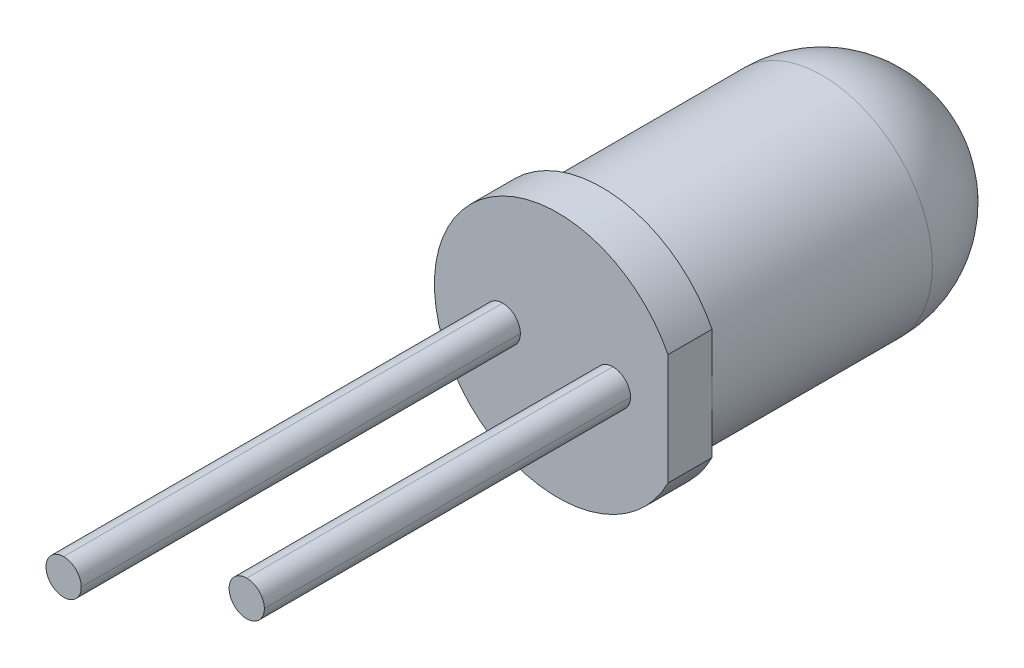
ISO-10303-21;
HEADER;
FILE_DESCRIPTION(('STEP AP214'),'2;1');
FILE_NAME('part.step','',(''),(''),'','','');
FILE_SCHEMA(('AUTOMOTIVE_DESIGN { 1 0 10303 214 1 1 1 1 }'));
ENDSEC;
DATA;
#1=APPLICATION_CONTEXT('core data for automotive mechanical design processes');
#2=APPLICATION_PROTOCOL_DEFINITION('international standard','automotive_design',2000,#1);
#3=PRODUCT_CONTEXT('',#1,'mechanical');
#4=PRODUCT('Part','Part','',(#3));
#5=PRODUCT_RELATED_PRODUCT_CATEGORY('part','',(#4));
#6=PRODUCT_DEFINITION_FORMATION('','',#4);
#7=PRODUCT_DEFINITION_CONTEXT('part definition',#1,'design');
#8=PRODUCT_DEFINITION('design','',#6,#7);
#9=PRODUCT_DEFINITION_SHAPE('','',#8);
#10=(LENGTH_UNIT() NAMED_UNIT(*) SI_UNIT(.MILLI.,.METRE.));
#11=(NAMED_UNIT(*) PLANE_ANGLE_UNIT() SI_UNIT($,.RADIAN.));
#12=(NAMED_UNIT(*) SI_UNIT($,.STERADIAN.) SOLID_ANGLE_UNIT());
#13=UNCERTAINTY_MEASURE_WITH_UNIT(LENGTH_MEASURE(1.E-05),#10,'distance_accuracy_value','');
#14=(GEOMETRIC_REPRESENTATION_CONTEXT(3) GLOBAL_UNCERTAINTY_ASSIGNED_CONTEXT((#13)) GLOBAL_UNIT_ASSIGNED_CONTEXT((#10,
#11,#12)) REPRESENTATION_CONTEXT('',''));
#15=CARTESIAN_POINT('',(0.,0.,0.));
#16=DIRECTION('',(0.,0.,1.));
#17=DIRECTION('',(1.,0.,0.));
#18=AXIS2_PLACEMENT_3D('',#15,#16,#17);
#19=CARTESIAN_POINT('',(0.,0.,8.5));
#20=DIRECTION('',(0.,0.,1.));
#21=DIRECTION('',(1.,0.,0.));
#22=AXIS2_PLACEMENT_3D('',#19,#20,#21);
#23=PLANE('',#22);
#24=CARTESIAN_POINT('',(-1.25,0.,8.5));
#25=DIRECTION('',(0.,0.,1.));
#26=DIRECTION('',(1.,0.,0.));
#27=AXIS2_PLACEMENT_3D('',#24,#25,#26);
#28=CIRCLE('',#27,0.4);
#29=CARTESIAN_POINT('',(-0.85,0.,8.5));
#30=VERTEX_POINT('',#29);
#31=CARTESIAN_POINT('',(-1.25,-0.4,8.5));
#32=VERTEX_POINT('',#31);
#33=EDGE_CURVE('E161',#30,#32,#28,.F.);
#34=ORIENTED_EDGE('',*,*,#33,.T.);
#35=CARTESIAN_POINT('',(-1.25,0.,8.5));
#36=DIRECTION('',(0.,0.,1.));
#37=DIRECTION('',(1.,0.,0.));
#38=AXIS2_PLACEMENT_3D('',#35,#36,#37);
#39=CIRCLE('',#38,0.4);
#40=CARTESIAN_POINT('',(-1.65,0.,8.5));
#41=VERTEX_POINT('',#40);
#42=EDGE_CURVE('E11',#32,#41,#39,.F.);
#43=ORIENTED_EDGE('',*,*,#42,.T.);
#44=CARTESIAN_POINT('',(-1.25,0.,8.5));
#45=DIRECTION('',(0.,0.,1.));
#46=DIRECTION('',(1.,0.,0.));
#47=AXIS2_PLACEMENT_3D('',#44,#45,#46);
#48=CIRCLE('',#47,0.4);
#49=CARTESIAN_POINT('',(-1.25,0.4,8.5));
#50=VERTEX_POINT('',#49);
#51=EDGE_CURVE('E32',#41,#50,#48,.F.);
#52=ORIENTED_EDGE('',*,*,#51,.T.);
#53=CARTESIAN_POINT('',(-1.25,0.,8.5));
#54=DIRECTION('',(0.,0.,1.));
#55=DIRECTION('',(1.,0.,0.));
#56=AXIS2_PLACEMENT_3D('',#53,#54,#55);
#57=CIRCLE('',#56,0.4);
#58=EDGE_CURVE('E158',#50,#30,#57,.F.);
#59=ORIENTED_EDGE('',*,*,#58,.T.);
#60=EDGE_LOOP('',(#34,#43,#52,#59));
#61=FACE_BOUND('',#60,.T.);
#62=CARTESIAN_POINT('',(1.24999999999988,0.,8.5));
#63=DIRECTION('',(0.,0.,1.));
#64=DIRECTION('',(1.,0.,0.));
#65=AXIS2_PLACEMENT_3D('',#62,#63,#64);
#66=CIRCLE('',#65,0.4);
#67=CARTESIAN_POINT('',(1.24999999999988,-0.4,8.5));
#68=VERTEX_POINT('',#67);
#69=CARTESIAN_POINT('',(0.849999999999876,0.,8.5));
#70=VERTEX_POINT('',#69);
#71=EDGE_CURVE('E45',#68,#70,#66,.F.);
#72=ORIENTED_EDGE('',*,*,#71,.T.);
#73=CARTESIAN_POINT('',(1.24999999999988,0.,8.5));
#74=DIRECTION('',(0.,0.,1.));
#75=DIRECTION('',(1.,0.,0.));
#76=AXIS2_PLACEMENT_3D('',#73,#74,#75);
#77=CIRCLE('',#76,0.4);
#78=CARTESIAN_POINT('',(1.24999999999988,0.4,8.5));
#79=VERTEX_POINT('',#78);
#80=EDGE_CURVE('E164',#70,#79,#77,.F.);
#81=ORIENTED_EDGE('',*,*,#80,.T.);
#82=CARTESIAN_POINT('',(1.24999999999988,0.,8.5));
#83=DIRECTION('',(0.,0.,1.));
#84=DIRECTION('',(1.,0.,0.));
#85=AXIS2_PLACEMENT_3D('',#82,#83,#84);
#86=CIRCLE('',#85,0.4);
#87=CARTESIAN_POINT('',(1.64999999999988,0.,8.5));
#88=VERTEX_POINT('',#87);
#89=EDGE_CURVE('E153',#79,#88,#86,.F.);
#90=ORIENTED_EDGE('',*,*,#89,.T.);
#91=CARTESIAN_POINT('',(1.24999999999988,0.,8.5));
#92=DIRECTION('',(0.,0.,1.));
#93=DIRECTION('',(1.,0.,0.));
#94=AXIS2_PLACEMENT_3D('',#91,#92,#93);
#95=CIRCLE('',#94,0.4);
#96=EDGE_CURVE('E156',#88,#68,#95,.F.);
#97=ORIENTED_EDGE('',*,*,#96,.T.);
#98=EDGE_LOOP('',(#72,#81,#90,#97));
#99=FACE_BOUND('',#98,.T.);
#100=DIRECTION('',(0.,1.,0.));
#101=VECTOR('',#100,1.);
#102=CARTESIAN_POINT('',(2.5,1.26095202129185,8.5));
#103=LINE('',#102,#101);
#104=CARTESIAN_POINT('',(2.5,-1.26095202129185,8.5));
#105=VERTEX_POINT('',#104);
#106=CARTESIAN_POINT('',(2.5,1.26095202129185,8.5));
#107=VERTEX_POINT('',#106);
#108=EDGE_CURVE('E117',#105,#107,#103,.T.);
#109=ORIENTED_EDGE('',*,*,#108,.T.);
#110=CARTESIAN_POINT('',(0.,0.,8.5));
#111=DIRECTION('',(0.,0.,1.));
#112=DIRECTION('',(1.,0.,0.));
#113=AXIS2_PLACEMENT_3D('',#110,#111,#112);
#114=CIRCLE('',#113,2.8);
#115=EDGE_CURVE('E106',#107,#105,#114,.T.);
#116=ORIENTED_EDGE('',*,*,#115,.T.);
#117=EDGE_LOOP('',(#109,#116));
#118=FACE_BOUND('',#117,.T.);
#119=ADVANCED_FACE('F24',(#61,#99,#118),#23,.T.);
#120=CARTESIAN_POINT('',(0.,0.,8.5));
#121=DIRECTION('',(0.,0.,-1.));
#122=DIRECTION('',(-1.,0.,0.));
#123=AXIS2_PLACEMENT_3D('',#120,#121,#122);
#124=CYLINDRICAL_SURFACE('',#123,2.5);
#125=CARTESIAN_POINT('',(0.,0.,2.5));
#126=DIRECTION('',(0.,0.,-1.));
#127=DIRECTION('',(-1.,0.,0.));
#128=AXIS2_PLACEMENT_3D('',#125,#126,#127);
#129=CIRCLE('',#128,2.5);
#130=CARTESIAN_POINT('',(-2.5,0.,2.5));
#131=VERTEX_POINT('',#130);
#132=EDGE_CURVE('E132',#131,#131,#129,.F.);
#133=ORIENTED_EDGE('',*,*,#132,.T.);
#134=EDGE_LOOP('',(#133));
#135=FACE_BOUND('',#134,.T.);
#136=CARTESIAN_POINT('',(0.,0.,7.5));
#137=DIRECTION('',(0.,0.,1.));
#138=DIRECTION('',(1.,0.,0.));
#139=AXIS2_PLACEMENT_3D('',#136,#137,#138);
#140=CIRCLE('',#139,2.5);
#141=CARTESIAN_POINT('',(2.5,0.,7.5));
#142=VERTEX_POINT('',#141);
#143=EDGE_CURVE('E128',#142,#142,#140,.T.);
#144=ORIENTED_EDGE('',*,*,#143,.F.);
#145=EDGE_LOOP('',(#144));
#146=FACE_BOUND('',#145,.T.);
#147=ADVANCED_FACE('F26',(#135,#146),#124,.T.);
#148=CARTESIAN_POINT('',(0.,0.,7.5));
#149=DIRECTION('',(0.,0.,1.));
#150=DIRECTION('',(1.,0.,0.));
#151=AXIS2_PLACEMENT_3D('',#148,#149,#150);
#152=PLANE('',#151);
#153=DIRECTION('',(0.,1.,0.));
#154=VECTOR('',#153,1.);
#155=CARTESIAN_POINT('',(2.5,1.26095202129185,7.5));
#156=LINE('',#155,#154);
#157=CARTESIAN_POINT('',(2.5,1.26095202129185,7.5));
#158=VERTEX_POINT('',#157);
#159=EDGE_CURVE('E123',#142,#158,#156,.T.);
#160=ORIENTED_EDGE('',*,*,#159,.F.);
#161=ORIENTED_EDGE('',*,*,#143,.T.);
#162=CARTESIAN_POINT('',(2.5,-1.26095202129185,7.5));
#163=VERTEX_POINT('',#162);
#164=EDGE_CURVE('E114',#163,#142,#156,.T.);
#165=ORIENTED_EDGE('',*,*,#164,.F.);
#166=CARTESIAN_POINT('',(0.,0.,7.5));
#167=DIRECTION('',(0.,0.,1.));
#168=DIRECTION('',(1.,0.,0.));
#169=AXIS2_PLACEMENT_3D('',#166,#167,#168);
#170=CIRCLE('',#169,2.8);
#171=EDGE_CURVE('E108',#158,#163,#170,.T.);
#172=ORIENTED_EDGE('',*,*,#171,.F.);
#173=EDGE_LOOP('',(#160,#161,#165,#172));
#174=FACE_BOUND('',#173,.T.);
#175=ADVANCED_FACE('F237',(#174),#152,.F.);
#176=CARTESIAN_POINT('',(2.5,1.26095202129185,7.5));
#177=DIRECTION('',(1.,0.,0.));
#178=DIRECTION('',(0.,0.,-1.));
#179=AXIS2_PLACEMENT_3D('',#176,#177,#178);
#180=PLANE('',#179);
#181=ORIENTED_EDGE('',*,*,#164,.T.);
#182=ORIENTED_EDGE('',*,*,#159,.T.);
#183=DIRECTION('',(0.,0.,1.));
#184=VECTOR('',#183,1.);
#185=CARTESIAN_POINT('',(2.5,1.26095202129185,7.5));
#186=LINE('',#185,#184);
#187=EDGE_CURVE('E113',#158,#107,#186,.T.);
#188=ORIENTED_EDGE('',*,*,#187,.T.);
#189=ORIENTED_EDGE('',*,*,#108,.F.);
#190=DIRECTION('',(0.,0.,1.));
#191=VECTOR('',#190,1.);
#192=CARTESIAN_POINT('',(2.5,-1.26095202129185,7.5));
#193=LINE('',#192,#191);
#194=EDGE_CURVE('E102',#163,#105,#193,.T.);
#195=ORIENTED_EDGE('',*,*,#194,.F.);
#196=EDGE_LOOP('',(#181,#182,#188,#189,#195));
#197=FACE_BOUND('',#196,.T.);
#198=ADVANCED_FACE('F121',(#197),#180,.T.);
#199=CARTESIAN_POINT('',(0.,0.,7.5));
#200=DIRECTION('',(0.,0.,1.));
#201=DIRECTION('',(1.,0.,0.));
#202=AXIS2_PLACEMENT_3D('',#199,#200,#201);
#203=CYLINDRICAL_SURFACE('',#202,2.8);
#204=ORIENTED_EDGE('',*,*,#115,.F.);
#205=ORIENTED_EDGE('',*,*,#187,.F.);
#206=ORIENTED_EDGE('',*,*,#171,.T.);
#207=ORIENTED_EDGE('',*,*,#194,.T.);
#208=EDGE_LOOP('',(#204,#205,#206,#207));
#209=FACE_BOUND('',#208,.T.);
#210=ADVANCED_FACE('F104',(#209),#203,.T.);
#211=CARTESIAN_POINT('',(0.,0.,2.5));
#212=DIRECTION('',(0.,0.,1.));
#213=DIRECTION('',(1.,0.,0.));
#214=AXIS2_PLACEMENT_3D('',#211,#212,#213);
#215=SPHERICAL_SURFACE('',#214,2.5);
#216=ORIENTED_EDGE('',*,*,#132,.F.);
#217=EDGE_LOOP('',(#216));
#218=FACE_BOUND('',#217,.T.);
#219=ADVANCED_FACE('F223',(#218),#215,.T.);
#220=CARTESIAN_POINT('',(1.65,0.4,16.8089310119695));
#221=DIRECTION('',(0.,0.,-1.));
#222=DIRECTION('',(-1.,0.,0.));
#223=AXIS2_PLACEMENT_3D('',#220,#221,#222);
#224=PLANE('',#223);
#225=CARTESIAN_POINT('',(1.25,0.,16.8089310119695));
#226=DIRECTION('',(0.,0.,-1.));
#227=DIRECTION('',(-1.,0.,0.));
#228=AXIS2_PLACEMENT_3D('',#225,#226,#227);
#229=CIRCLE('',#228,0.4);
#230=CARTESIAN_POINT('',(1.25,-0.4,16.8089310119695));
#231=VERTEX_POINT('',#230);
#232=CARTESIAN_POINT('',(1.65,0.,16.8089310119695));
#233=VERTEX_POINT('',#232);
#234=EDGE_CURVE('E139',#231,#233,#229,.F.);
#235=ORIENTED_EDGE('',*,*,#234,.T.);
#236=CARTESIAN_POINT('',(1.25,0.,16.8089310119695));
#237=DIRECTION('',(0.,0.,-1.));
#238=DIRECTION('',(-1.,0.,0.));
#239=AXIS2_PLACEMENT_3D('',#236,#237,#238);
#240=CIRCLE('',#239,0.4);
#241=CARTESIAN_POINT('',(1.25,0.4,16.8089310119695));
#242=VERTEX_POINT('',#241);
#243=EDGE_CURVE('E141',#233,#242,#240,.F.);
#244=ORIENTED_EDGE('',*,*,#243,.T.);
#245=CARTESIAN_POINT('',(1.25,0.,16.8089310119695));
#246=DIRECTION('',(0.,0.,-1.));
#247=DIRECTION('',(-1.,0.,0.));
#248=AXIS2_PLACEMENT_3D('',#245,#246,#247);
#249=CIRCLE('',#248,0.4);
#250=CARTESIAN_POINT('',(0.85,0.,16.8089310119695));
#251=VERTEX_POINT('',#250);
#252=EDGE_CURVE('E135',#242,#251,#249,.F.);
#253=ORIENTED_EDGE('',*,*,#252,.T.);
#254=CARTESIAN_POINT('',(1.25,0.,16.8089310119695));
#255=DIRECTION('',(0.,0.,-1.));
#256=DIRECTION('',(-1.,0.,0.));
#257=AXIS2_PLACEMENT_3D('',#254,#255,#256);
#258=CIRCLE('',#257,0.4);
#259=EDGE_CURVE('E137',#251,#231,#258,.F.);
#260=ORIENTED_EDGE('',*,*,#259,.T.);
#261=EDGE_LOOP('',(#235,#244,#253,#260));
#262=FACE_BOUND('',#261,.T.);
#263=ADVANCED_FACE('F220',(#262),#224,.F.);
#264=CARTESIAN_POINT('',(-0.85,0.4,18.4635991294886));
#265=DIRECTION('',(0.,0.,-1.));
#266=DIRECTION('',(-1.,0.,0.));
#267=AXIS2_PLACEMENT_3D('',#264,#265,#266);
#268=PLANE('',#267);
#269=CARTESIAN_POINT('',(-1.25,0.,18.4635991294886));
#270=DIRECTION('',(0.,0.,-1.));
#271=DIRECTION('',(-1.,0.,0.));
#272=AXIS2_PLACEMENT_3D('',#269,#270,#271);
#273=CIRCLE('',#272,0.4);
#274=CARTESIAN_POINT('',(-1.25,-0.4,18.4635991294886));
#275=VERTEX_POINT('',#274);
#276=CARTESIAN_POINT('',(-0.85,0.,18.4635991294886));
#277=VERTEX_POINT('',#276);
#278=EDGE_CURVE('E148',#275,#277,#273,.F.);
#279=ORIENTED_EDGE('',*,*,#278,.T.);
#280=CARTESIAN_POINT('',(-1.25,0.,18.4635991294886));
#281=DIRECTION('',(0.,0.,-1.));
#282=DIRECTION('',(-1.,0.,0.));
#283=AXIS2_PLACEMENT_3D('',#280,#281,#282);
#284=CIRCLE('',#283,0.4);
#285=CARTESIAN_POINT('',(-1.25,0.4,18.4635991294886));
#286=VERTEX_POINT('',#285);
#287=EDGE_CURVE('E150',#277,#286,#284,.F.);
#288=ORIENTED_EDGE('',*,*,#287,.T.);
#289=CARTESIAN_POINT('',(-1.25,0.,18.4635991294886));
#290=DIRECTION('',(0.,0.,-1.));
#291=DIRECTION('',(-1.,0.,0.));
#292=AXIS2_PLACEMENT_3D('',#289,#290,#291);
#293=CIRCLE('',#292,0.4);
#294=CARTESIAN_POINT('',(-1.65,0.,18.4635991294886));
#295=VERTEX_POINT('',#294);
#296=EDGE_CURVE('E146',#286,#295,#293,.F.);
#297=ORIENTED_EDGE('',*,*,#296,.T.);
#298=CARTESIAN_POINT('',(-1.25,0.,18.4635991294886));
#299=DIRECTION('',(0.,0.,-1.));
#300=DIRECTION('',(-1.,0.,0.));
#301=AXIS2_PLACEMENT_3D('',#298,#299,#300);
#302=CIRCLE('',#301,0.4);
#303=EDGE_CURVE('E144',#295,#275,#302,.F.);
#304=ORIENTED_EDGE('',*,*,#303,.T.);
#305=EDGE_LOOP('',(#279,#288,#297,#304));
#306=FACE_BOUND('',#305,.T.);
#307=ADVANCED_FACE('F222',(#306),#268,.F.);
#308=CARTESIAN_POINT('',(1.24999999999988,0.,8.48));
#309=DIRECTION('',(0.,0.,-1.));
#310=DIRECTION('',(-1.,0.,0.));
#311=AXIS2_PLACEMENT_3D('',#308,#309,#310);
#312=CYLINDRICAL_SURFACE('',#311,0.4);
#313=DIRECTION('',(0.,0.,1.));
#314=VECTOR('',#313,1.);
#315=CARTESIAN_POINT('',(0.85,0.,16.8089310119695));
#316=LINE('',#315,#314);
#317=EDGE_CURVE('E198',#70,#251,#316,.T.);
#318=ORIENTED_EDGE('',*,*,#317,.F.);
#319=ORIENTED_EDGE('',*,*,#71,.F.);
#320=DIRECTION('',(0.,0.,1.));
#321=VECTOR('',#320,1.);
#322=CARTESIAN_POINT('',(1.24999999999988,-0.4,8.49999999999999));
#323=LINE('',#322,#321);
#324=EDGE_CURVE('E119',#231,#68,#323,.F.);
#325=ORIENTED_EDGE('',*,*,#324,.F.);
#326=ORIENTED_EDGE('',*,*,#259,.F.);
#327=EDGE_LOOP('',(#318,#319,#325,#326));
#328=FACE_BOUND('',#327,.T.);
#329=ADVANCED_FACE('F209',(#328),#312,.T.);
#330=CARTESIAN_POINT('',(1.24999999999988,0.,8.48));
#331=DIRECTION('',(0.,0.,1.));
#332=DIRECTION('',(1.,0.,0.));
#333=AXIS2_PLACEMENT_3D('',#330,#331,#332);
#334=CYLINDRICAL_SURFACE('',#333,0.4);
#335=ORIENTED_EDGE('',*,*,#324,.T.);
#336=ORIENTED_EDGE('',*,*,#96,.F.);
#337=DIRECTION('',(0.,0.,-1.));
#338=VECTOR('',#337,1.);
#339=CARTESIAN_POINT('',(1.64999999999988,0.,8.5));
#340=LINE('',#339,#338);
#341=EDGE_CURVE('E196',#233,#88,#340,.T.);
#342=ORIENTED_EDGE('',*,*,#341,.F.);
#343=ORIENTED_EDGE('',*,*,#234,.F.);
#344=EDGE_LOOP('',(#335,#336,#342,#343));
#345=FACE_BOUND('',#344,.T.);
#346=ADVANCED_FACE('F205',(#345),#334,.T.);
#347=CARTESIAN_POINT('',(1.24999999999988,0.,8.48));
#348=DIRECTION('',(0.,0.,1.));
#349=DIRECTION('',(1.,0.,0.));
#350=AXIS2_PLACEMENT_3D('',#347,#348,#349);
#351=CYLINDRICAL_SURFACE('',#350,0.4);
#352=ORIENTED_EDGE('',*,*,#317,.T.);
#353=ORIENTED_EDGE('',*,*,#252,.F.);
#354=DIRECTION('',(0.,0.,1.));
#355=VECTOR('',#354,1.);
#356=CARTESIAN_POINT('',(1.24999999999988,0.4,8.48));
#357=LINE('',#356,#355);
#358=EDGE_CURVE('E192',#79,#242,#357,.T.);
#359=ORIENTED_EDGE('',*,*,#358,.F.);
#360=ORIENTED_EDGE('',*,*,#80,.F.);
#361=EDGE_LOOP('',(#352,#353,#359,#360));
#362=FACE_BOUND('',#361,.T.);
#363=ADVANCED_FACE('F214',(#362),#351,.T.);
#364=CARTESIAN_POINT('',(1.24999999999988,0.,8.48));
#365=DIRECTION('',(0.,0.,-1.));
#366=DIRECTION('',(-1.,0.,0.));
#367=AXIS2_PLACEMENT_3D('',#364,#365,#366);
#368=CYLINDRICAL_SURFACE('',#367,0.4);
#369=ORIENTED_EDGE('',*,*,#243,.F.);
#370=ORIENTED_EDGE('',*,*,#341,.T.);
#371=ORIENTED_EDGE('',*,*,#89,.F.);
#372=ORIENTED_EDGE('',*,*,#358,.T.);
#373=EDGE_LOOP('',(#369,#370,#371,#372));
#374=FACE_BOUND('',#373,.T.);
#375=ADVANCED_FACE('F218',(#374),#368,.T.);
#376=CARTESIAN_POINT('',(-1.25,0.,8.48));
#377=DIRECTION('',(0.,0.,-1.));
#378=DIRECTION('',(-1.,0.,0.));
#379=AXIS2_PLACEMENT_3D('',#376,#377,#378);
#380=CYLINDRICAL_SURFACE('',#379,0.4);
#381=DIRECTION('',(0.,0.,1.));
#382=VECTOR('',#381,1.);
#383=CARTESIAN_POINT('',(-1.65,0.,18.4635991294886));
#384=LINE('',#383,#382);
#385=EDGE_CURVE('E182',#41,#295,#384,.T.);
#386=ORIENTED_EDGE('',*,*,#385,.F.);
#387=ORIENTED_EDGE('',*,*,#42,.F.);
#388=DIRECTION('',(0.,0.,1.));
#389=VECTOR('',#388,1.);
#390=CARTESIAN_POINT('',(-1.25,-0.4,8.5));
#391=LINE('',#390,#389);
#392=EDGE_CURVE('E187',#275,#32,#391,.F.);
#393=ORIENTED_EDGE('',*,*,#392,.F.);
#394=ORIENTED_EDGE('',*,*,#303,.F.);
#395=EDGE_LOOP('',(#386,#387,#393,#394));
#396=FACE_BOUND('',#395,.T.);
#397=ADVANCED_FACE('F189',(#396),#380,.T.);
#398=CARTESIAN_POINT('',(-1.25,0.,8.48));
#399=DIRECTION('',(0.,0.,1.));
#400=DIRECTION('',(1.,0.,0.));
#401=AXIS2_PLACEMENT_3D('',#398,#399,#400);
#402=CYLINDRICAL_SURFACE('',#401,0.4);
#403=ORIENTED_EDGE('',*,*,#392,.T.);
#404=ORIENTED_EDGE('',*,*,#33,.F.);
#405=DIRECTION('',(0.,0.,-1.));
#406=VECTOR('',#405,1.);
#407=CARTESIAN_POINT('',(-0.85,0.,8.5));
#408=LINE('',#407,#406);
#409=EDGE_CURVE('E175',#277,#30,#408,.T.);
#410=ORIENTED_EDGE('',*,*,#409,.F.);
#411=ORIENTED_EDGE('',*,*,#278,.F.);
#412=EDGE_LOOP('',(#403,#404,#410,#411));
#413=FACE_BOUND('',#412,.T.);
#414=ADVANCED_FACE('F185',(#413),#402,.T.);
#415=CARTESIAN_POINT('',(-1.25,0.,18.4635991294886));
#416=DIRECTION('',(0.,0.,1.));
#417=DIRECTION('',(1.,0.,0.));
#418=AXIS2_PLACEMENT_3D('',#415,#416,#417);
#419=CYLINDRICAL_SURFACE('',#418,0.4);
#420=ORIENTED_EDGE('',*,*,#385,.T.);
#421=ORIENTED_EDGE('',*,*,#296,.F.);
#422=DIRECTION('',(0.,0.,1.));
#423=VECTOR('',#422,1.);
#424=CARTESIAN_POINT('',(-1.25,0.4,18.4635991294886));
#425=LINE('',#424,#423);
#426=EDGE_CURVE('E171',#50,#286,#425,.T.);
#427=ORIENTED_EDGE('',*,*,#426,.F.);
#428=ORIENTED_EDGE('',*,*,#51,.F.);
#429=EDGE_LOOP('',(#420,#421,#427,#428));
#430=FACE_BOUND('',#429,.T.);
#431=ADVANCED_FACE('F172',(#430),#419,.T.);
#432=CARTESIAN_POINT('',(-1.25,0.,18.4635991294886));
#433=DIRECTION('',(0.,0.,-1.));
#434=DIRECTION('',(-1.,0.,0.));
#435=AXIS2_PLACEMENT_3D('',#432,#433,#434);
#436=CYLINDRICAL_SURFACE('',#435,0.4);
#437=ORIENTED_EDGE('',*,*,#287,.F.);
#438=ORIENTED_EDGE('',*,*,#409,.T.);
#439=ORIENTED_EDGE('',*,*,#58,.F.);
#440=ORIENTED_EDGE('',*,*,#426,.T.);
#441=EDGE_LOOP('',(#437,#438,#439,#440));
#442=FACE_BOUND('',#441,.T.);
#443=ADVANCED_FACE('F177',(#442),#436,.T.);
#444=CLOSED_SHELL('',(#119,#147,#175,#198,#210,#219,#263,#307,#329,#346,#363,#375,#397,#414,
#431,#443));
#445=MANIFOLD_SOLID_BREP('B2',#444);
#446=ADVANCED_BREP_SHAPE_REPRESENTATION('',(#18,#445),#14);
#447=SHAPE_DEFINITION_REPRESENTATION(#9,#446);
ENDSEC;
END-ISO-10303-21;
